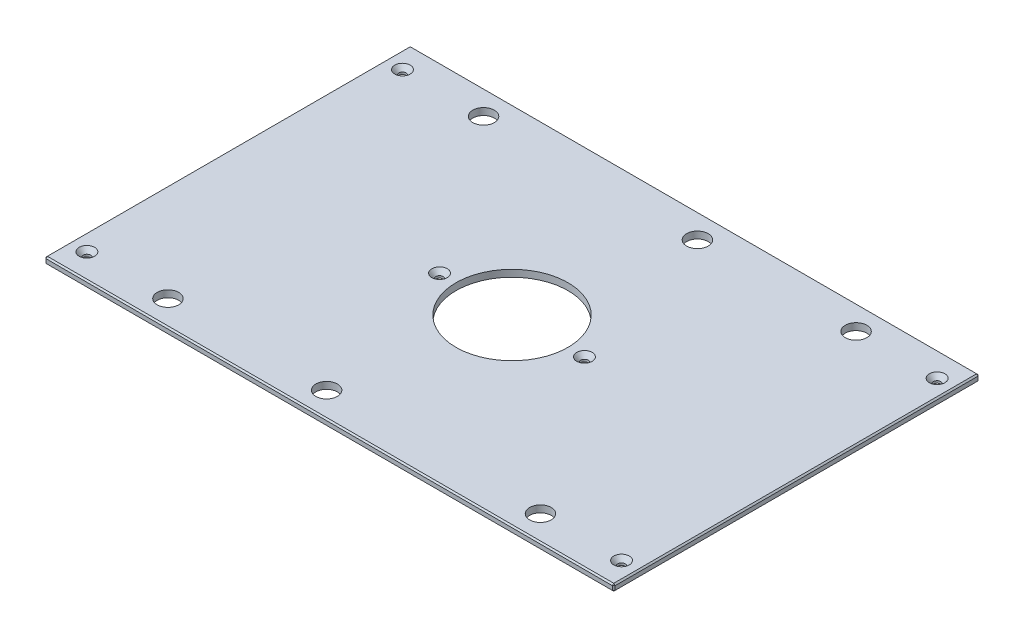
from build123d import *

# Parameters (mm, degrees)
SKETCH1_W                                     = 523.875
SKETCH1_H                                     = 336.55
BOSS_EXTRUDE1_DEPTH                           = 6.35
SKETCH13_R                                    = 51.562
CUT_EXTRUDE6_DEPTH                            = 312.396936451
F_25_32_0_78125_DIAMETER_HOLE1_D              = 19.84375
CHAMFER2_SIZE                                 = 1.27
CSK_FOR_1_4_FLAT_HEAD_MACHINE_SCREW1_AT_COUNT = 2
CSK_FOR_1_4_FLAT_HEAD_MACHINE_SCREW1_AT_PITCH = 290.50996
CSK_FOR_1_4_FLAT_HEAD_MACHINE_SCREW1_2_COUNT  = 2
CSK_FOR_1_4_FLAT_HEAD_MACHINE_SCREW1_2_PITCH  = 571.474454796
CSK_FOR_1_4_FLAT_HEAD_MACHINE_SCREW1_3_COUNT  = 2
CSK_FOR_1_4_FLAT_HEAD_MACHINE_SCREW1_3_PITCH  = 344.824235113
CSK_FOR_1_4_FLAT_HEAD_MACHINE_SCREW1_4_COUNT  = 2
CSK_FOR_1_4_FLAT_HEAD_MACHINE_SCREW1_4_PITCH  = 230.822192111
CSK_FOR_1_4_FLAT_HEAD_MACHINE_SCREW1_5_COUNT  = 2
CSK_FOR_1_4_FLAT_HEAD_MACHINE_SCREW1_5_PITCH  = 492.125
CSK_FOR_1_4_FLAT_HEAD_MACHINE_SCREW1_6_COUNT  = 2
CSK_FOR_1_4_FLAT_HEAD_MACHINE_SCREW1_6_PITCH  = 417.5125
CSK_FOR_1_4_FLAT_HEAD_MACHINE_SCREW1_7_COUNT  = 2
CSK_FOR_1_4_FLAT_HEAD_MACHINE_SCREW1_7_PITCH  = 508.638107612


with BuildPart() as part:
    # Sketch1 → Boss-Extrude1 (new body)
    with BuildSketch(Plane(origin=(0, 0, 0), x_dir=(1, 0, 0), z_dir=(0, 1, 0))):
        Rectangle(SKETCH1_W, SKETCH1_H)
    extrude(amount=BOSS_EXTRUDE1_DEPTH)

    # Sketch13 → Cut-Extrude6 (cut, through all)
    with BuildSketch(Plane(origin=(0, 6.35, 0), x_dir=(1, 0, 0), z_dir=(0, 1, 0))):
        with Locations(Location((0, 0, 0), (0, 0, 270))):
            Circle(SKETCH13_R)
    extrude(amount=-CUT_EXTRUDE6_DEPTH, mode=Mode.SUBTRACT)

    # 25_32 _0.78125_ Diameter Hole1 (through all)
    with Locations(Plane(origin=(0, 6.35, 0), x_dir=(1, 0, 0), z_dir=(0, 1, 0))):
        with Locations((171.45, 145.25498), (-171.45, 145.25498), (171.45, -145.25498), (-171.45, -145.25498), (25.4, 145.25498), (-25.4, -145.25498)):
            Hole(F_25_32_0_78125_DIAMETER_HOLE1_D / 2)

    # Chamfer2
    chamfer2_edges = [part.edges().sort_by_distance(p)[0] for p in [
        (261.9375, 6.35, 0),
        (0, 6.35, -168.275),
        (-261.9375, 6.35, 0),
        (0, 0, -168.275),
        (261.9375, 0, 0),
        (0, 0, 168.275),
        (-261.9375, 0, 0),
        (0, 6.35, 168.275),
        (-261.9375, 3.175, -168.275),
        (261.9375, 3.175, -168.275),
        (261.9375, 3.175, 168.275),
        (-261.9375, 3.175, 168.275),
    ]]
    chamfer(chamfer2_edges, length=CHAMFER2_SIZE)

    # Sketch24 → CSK for 1_4 Flat Head Machine Screw1 (revolve, cut)
    with BuildSketch(Plane(origin=(246.0625, 6.35, -145.25498), x_dir=(0, 0, 1), z_dir=(1, 0, 0))):
        Polygon((0, 0), (0, 6.35), (3.3782, 6.35), (3.3782, 4.324464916), (7.1374, 0), align=None)
    csk_for_1_4_flat_head_machine_screw1 = revolve(axis=Axis((246.0625, 12.7, -145.25498), (0, -1, 0)), mode=Mode.SUBTRACT)

    # CSK for 1_4 Flat Head Machine Screw1 at: CSK for 1_4 Flat Head Machine Screw1 ×2
    with Locations(*[(0, 0, i * CSK_FOR_1_4_FLAT_HEAD_MACHINE_SCREW1_AT_PITCH) for i in range(1, CSK_FOR_1_4_FLAT_HEAD_MACHINE_SCREW1_AT_COUNT)]):
        add(csk_for_1_4_flat_head_machine_screw1, mode=Mode.SUBTRACT)

    # CSK for 1_4 Flat Head Machine Screw1 2: CSK for 1_4 Flat Head Machine Screw1 ×2
    with Locations(*[Vector(-0.861149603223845, 0, 0.5083516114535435) * (i * CSK_FOR_1_4_FLAT_HEAD_MACHINE_SCREW1_2_PITCH) for i in range(1, CSK_FOR_1_4_FLAT_HEAD_MACHINE_SCREW1_2_COUNT)]):
        add(csk_for_1_4_flat_head_machine_screw1, mode=Mode.SUBTRACT)

    # CSK for 1_4 Flat Head Machine Screw1 3: CSK for 1_4 Flat Head Machine Screw1 ×2
    with Locations(*[Vector(-0.9069475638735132, 0, 0.4212435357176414) * (i * CSK_FOR_1_4_FLAT_HEAD_MACHINE_SCREW1_3_PITCH) for i in range(1, CSK_FOR_1_4_FLAT_HEAD_MACHINE_SCREW1_3_COUNT)]):
        add(csk_for_1_4_flat_head_machine_screw1, mode=Mode.SUBTRACT)

    # CSK for 1_4 Flat Head Machine Screw1 4: CSK for 1_4 Flat Head Machine Screw1 ×2
    with Locations(*[Vector(-0.7771674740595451, 0, 0.6292938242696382) * (i * CSK_FOR_1_4_FLAT_HEAD_MACHINE_SCREW1_4_PITCH) for i in range(1, CSK_FOR_1_4_FLAT_HEAD_MACHINE_SCREW1_4_COUNT)]):
        add(csk_for_1_4_flat_head_machine_screw1, mode=Mode.SUBTRACT)

    # CSK for 1_4 Flat Head Machine Screw1 5: CSK for 1_4 Flat Head Machine Screw1 ×2
    with Locations(*[(-i * CSK_FOR_1_4_FLAT_HEAD_MACHINE_SCREW1_5_PITCH, 0, 0) for i in range(1, CSK_FOR_1_4_FLAT_HEAD_MACHINE_SCREW1_5_COUNT)]):
        add(csk_for_1_4_flat_head_machine_screw1, mode=Mode.SUBTRACT)

    # CSK for 1_4 Flat Head Machine Screw1 6: CSK for 1_4 Flat Head Machine Screw1 ×2
    with Locations(*[(-i * CSK_FOR_1_4_FLAT_HEAD_MACHINE_SCREW1_6_PITCH, 0, 0) for i in range(1, CSK_FOR_1_4_FLAT_HEAD_MACHINE_SCREW1_6_COUNT)]):
        add(csk_for_1_4_flat_head_machine_screw1, mode=Mode.SUBTRACT)

    # CSK for 1_4 Flat Head Machine Screw1 7: CSK for 1_4 Flat Head Machine Screw1 ×2
    with Locations(*[Vector(-0.8208439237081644, 0, 0.5711525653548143) * (i * CSK_FOR_1_4_FLAT_HEAD_MACHINE_SCREW1_7_PITCH) for i in range(1, CSK_FOR_1_4_FLAT_HEAD_MACHINE_SCREW1_7_COUNT)]):
        add(csk_for_1_4_flat_head_machine_screw1, mode=Mode.SUBTRACT)


solid = part.part
